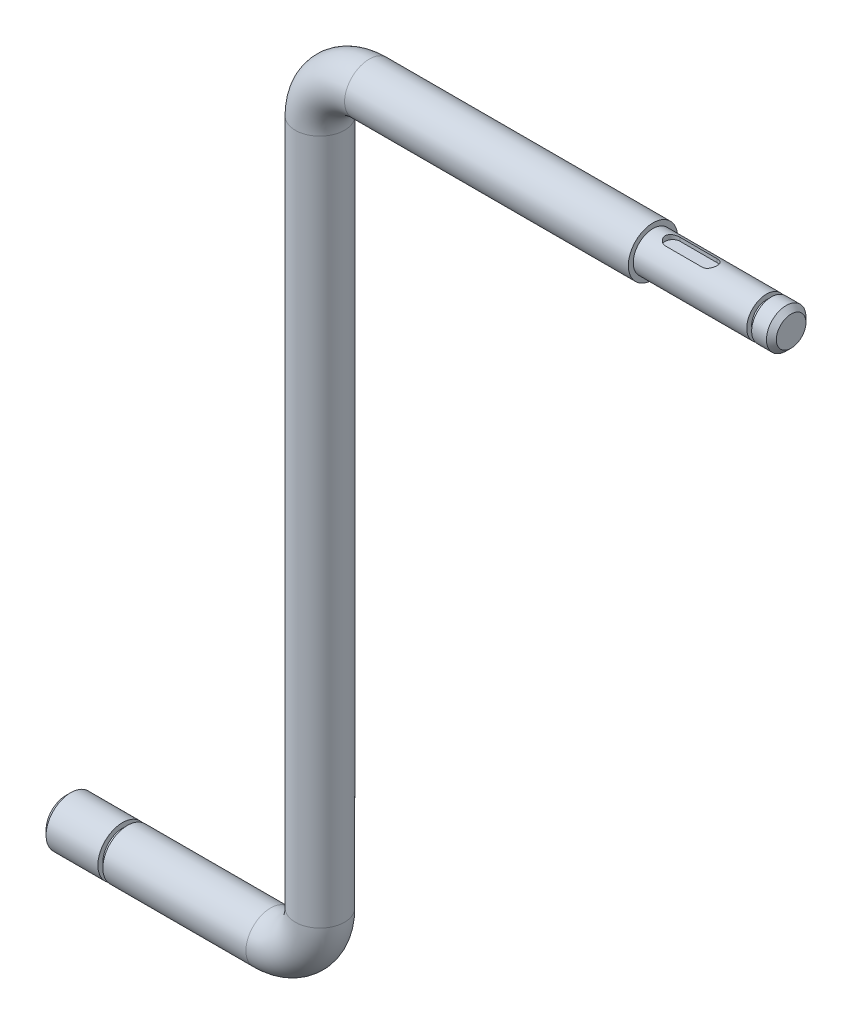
ISO-10303-21;
HEADER;
FILE_DESCRIPTION(('STEP AP214'),'2;1');
FILE_NAME('part.step','',(''),(''),'','','');
FILE_SCHEMA(('AUTOMOTIVE_DESIGN { 1 0 10303 214 1 1 1 1 }'));
ENDSEC;
DATA;
#1=APPLICATION_CONTEXT('core data for automotive mechanical design processes');
#2=APPLICATION_PROTOCOL_DEFINITION('international standard','automotive_design',2000,#1);
#3=PRODUCT_CONTEXT('',#1,'mechanical');
#4=PRODUCT('Part','Part','',(#3));
#5=PRODUCT_RELATED_PRODUCT_CATEGORY('part','',(#4));
#6=PRODUCT_DEFINITION_FORMATION('','',#4);
#7=PRODUCT_DEFINITION_CONTEXT('part definition',#1,'design');
#8=PRODUCT_DEFINITION('design','',#6,#7);
#9=PRODUCT_DEFINITION_SHAPE('','',#8);
#10=(LENGTH_UNIT() NAMED_UNIT(*) SI_UNIT(.MILLI.,.METRE.));
#11=(NAMED_UNIT(*) PLANE_ANGLE_UNIT() SI_UNIT($,.RADIAN.));
#12=(NAMED_UNIT(*) SI_UNIT($,.STERADIAN.) SOLID_ANGLE_UNIT());
#13=UNCERTAINTY_MEASURE_WITH_UNIT(LENGTH_MEASURE(1.E-05),#10,'distance_accuracy_value','');
#14=(GEOMETRIC_REPRESENTATION_CONTEXT(3) GLOBAL_UNCERTAINTY_ASSIGNED_CONTEXT((#13)) GLOBAL_UNIT_ASSIGNED_CONTEXT((#10,
#11,#12)) REPRESENTATION_CONTEXT('',''));
#15=CARTESIAN_POINT('',(0.,0.,0.));
#16=DIRECTION('',(0.,0.,1.));
#17=DIRECTION('',(1.,0.,0.));
#18=AXIS2_PLACEMENT_3D('',#15,#16,#17);
#19=CARTESIAN_POINT('',(147.,159.,0.));
#20=DIRECTION('',(-1.,0.,0.));
#21=DIRECTION('',(0.,-1.,0.));
#22=AXIS2_PLACEMENT_3D('',#19,#20,#21);
#23=CYLINDRICAL_SURFACE('',#22,4.);
#24=DIRECTION('',(-1.,0.,0.));
#25=VECTOR('',#24,1.);
#26=CARTESIAN_POINT('',(147.,162.708099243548,1.5));
#27=LINE('',#26,#25);
#28=CARTESIAN_POINT('',(130.5,162.708099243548,1.5));
#29=VERTEX_POINT('',#28);
#30=CARTESIAN_POINT('',(123.,162.708099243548,1.5));
#31=VERTEX_POINT('',#30);
#32=EDGE_CURVE('E469',#29,#31,#27,.T.);
#33=ORIENTED_EDGE('',*,*,#32,.T.);
#34=CARTESIAN_POINT('',(123.,162.708099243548,1.5));
#35=CARTESIAN_POINT('',(122.95940746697,162.708094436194,1.50000149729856));
#36=CARTESIAN_POINT('',(122.918836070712,162.708766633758,1.49835118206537));
#37=CARTESIAN_POINT('',(122.838015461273,162.711416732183,1.49177905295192));
#38=CARTESIAN_POINT('',(122.797766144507,162.713394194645,1.48685833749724));
#39=CARTESIAN_POINT('',(122.678232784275,162.721189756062,1.46729482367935));
#40=CARTESIAN_POINT('',(122.599800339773,162.728871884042,1.44784998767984));
#41=CARTESIAN_POINT('',(122.447632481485,162.748252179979,1.39690233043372));
#42=CARTESIAN_POINT('',(122.373893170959,162.759946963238,1.36540966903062));
#43=CARTESIAN_POINT('',(122.232666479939,162.786023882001,1.29134097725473));
#44=CARTESIAN_POINT('',(122.165184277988,162.800408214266,1.24875587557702));
#45=CARTESIAN_POINT('',(122.035108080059,162.831035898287,1.15146603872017));
#46=CARTESIAN_POINT('',(121.972869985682,162.847333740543,1.09630269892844));
#47=CARTESIAN_POINT('',(121.858276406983,162.879497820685,0.976394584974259));
#48=CARTESIAN_POINT('',(121.80592283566,162.895363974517,0.911647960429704));
#49=CARTESIAN_POINT('',(121.710859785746,162.925528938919,0.771693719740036));
#50=CARTESIAN_POINT('',(121.668539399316,162.939755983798,0.696204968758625));
#51=CARTESIAN_POINT('',(121.597348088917,162.964380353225,0.538553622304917));
#52=CARTESIAN_POINT('',(121.568472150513,162.974779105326,0.456393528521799));
#53=CARTESIAN_POINT('',(121.526242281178,162.990186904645,0.291490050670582));
#54=CARTESIAN_POINT('',(121.512272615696,162.99540906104,0.208924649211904));
#55=CARTESIAN_POINT('',(121.498278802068,163.000640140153,0.0424658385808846));
#56=CARTESIAN_POINT('',(121.498250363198,163.000650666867,-0.0414271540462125));
#57=CARTESIAN_POINT('',(121.511781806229,162.995592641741,-0.20374410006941));
#58=CARTESIAN_POINT('',(121.524669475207,162.990775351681,-0.282233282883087));
#59=CARTESIAN_POINT('',(121.562536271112,162.976932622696,-0.435840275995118));
#60=CARTESIAN_POINT('',(121.587516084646,162.967906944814,-0.510957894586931));
#61=CARTESIAN_POINT('',(121.649170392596,162.946377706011,-0.65698891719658));
#62=CARTESIAN_POINT('',(121.686009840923,162.933825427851,-0.727825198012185));
#63=CARTESIAN_POINT('',(121.770192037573,162.906513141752,-0.862486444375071));
#64=CARTESIAN_POINT('',(121.817538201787,162.891752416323,-0.926309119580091));
#65=CARTESIAN_POINT('',(121.924623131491,162.860526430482,-1.04908600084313));
#66=CARTESIAN_POINT('',(121.984924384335,162.844011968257,-1.10753779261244));
#67=CARTESIAN_POINT('',(122.114584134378,162.811826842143,-1.21369725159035));
#68=CARTESIAN_POINT('',(122.183946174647,162.796156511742,-1.26140069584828));
#69=CARTESIAN_POINT('',(122.331758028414,162.767118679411,-1.34567998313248));
#70=CARTESIAN_POINT('',(122.410378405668,162.753811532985,-1.38197861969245));
#71=CARTESIAN_POINT('',(122.573206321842,162.731714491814,-1.44059114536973));
#72=CARTESIAN_POINT('',(122.657404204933,162.722917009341,-1.46292853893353));
#73=CARTESIAN_POINT('',(122.785381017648,162.714062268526,-1.48519272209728));
#74=CARTESIAN_POINT('',(122.828102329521,162.711834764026,-1.49074028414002));
#75=CARTESIAN_POINT('',(122.913874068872,162.708850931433,-1.49814308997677));
#76=CARTESIAN_POINT('',(122.956924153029,162.708093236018,-1.50000176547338));
#77=CARTESIAN_POINT('',(123.,162.708099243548,-1.5));
#78=B_SPLINE_CURVE_WITH_KNOTS('',3,(#34,#35,#36,#37,#38,#39,#40,#41,#42,#43,#44,#45,#46,#47,#48,
#49,#50,#51,#52,#53,#54,#55,#56,#57,#58,#59,#60,#61,#62,#63,#64,#65,#66,#67,#68,#69,#70,#71,#72,
#73,#74,#75,#76,#77),.UNSPECIFIED.,.F.,.F.,(4,2,2,2,2,2,2,2,2,2,2,2,2,2,2,2,2,2,2,2,2,4),(0.,
0.121697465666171,0.243354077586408,0.485593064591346,0.727628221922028,0.969861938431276,
1.22298027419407,1.47614754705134,1.73793539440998,1.9996255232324,2.25002925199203,
2.50035591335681,2.73829765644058,2.97625291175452,3.21767225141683,3.45917019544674,
3.7147799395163,3.97048993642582,4.23200510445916,4.4930788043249,4.62233004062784,
4.75146098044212),.UNSPECIFIED.);
#79=CARTESIAN_POINT('',(123.,162.708099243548,-1.5));
#80=VERTEX_POINT('',#79);
#81=EDGE_CURVE('E11',#31,#80,#78,.T.);
#82=ORIENTED_EDGE('',*,*,#81,.T.);
#83=DIRECTION('',(-1.,0.,0.));
#84=VECTOR('',#83,1.);
#85=CARTESIAN_POINT('',(147.,162.708099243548,-1.5));
#86=LINE('',#85,#84);
#87=CARTESIAN_POINT('',(130.5,162.708099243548,-1.5));
#88=VERTEX_POINT('',#87);
#89=EDGE_CURVE('E363',#80,#88,#86,.F.);
#90=ORIENTED_EDGE('',*,*,#89,.T.);
#91=CARTESIAN_POINT('',(130.5,162.708099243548,1.5));
#92=CARTESIAN_POINT('',(130.418992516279,162.708096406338,1.50000304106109));
#93=CARTESIAN_POINT('',(130.338005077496,162.71078260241,1.49341597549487));
#94=CARTESIAN_POINT('',(130.178471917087,162.72116159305,1.46736187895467));
#95=CARTESIAN_POINT('',(130.099926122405,162.728854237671,1.44789523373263));
#96=CARTESIAN_POINT('',(129.947624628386,162.748254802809,1.39689657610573));
#97=CARTESIAN_POINT('',(129.873857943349,162.759953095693,1.36539347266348));
#98=CARTESIAN_POINT('',(129.732628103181,162.786031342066,1.29131856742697));
#99=CARTESIAN_POINT('',(129.665166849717,162.800412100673,1.24874344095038));
#100=CARTESIAN_POINT('',(129.535109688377,162.831035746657,1.15146661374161));
#101=CARTESIAN_POINT('',(129.472871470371,162.847333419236,1.09630381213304));
#102=CARTESIAN_POINT('',(129.358277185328,162.879497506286,0.976395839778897));
#103=CARTESIAN_POINT('',(129.305923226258,162.895363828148,0.911648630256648));
#104=CARTESIAN_POINT('',(129.210860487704,162.925528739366,0.771694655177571));
#105=CARTESIAN_POINT('',(129.168540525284,162.939755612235,0.696206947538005));
#106=CARTESIAN_POINT('',(129.097348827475,162.964380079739,0.538555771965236));
#107=CARTESIAN_POINT('',(129.068472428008,162.97477900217,0.45639463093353));
#108=CARTESIAN_POINT('',(129.026242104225,162.990186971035,0.29148934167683));
#109=CARTESIAN_POINT('',(129.01227237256,162.995409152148,0.208923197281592));
#110=CARTESIAN_POINT('',(128.998278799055,163.00064014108,0.0424643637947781));
#111=CARTESIAN_POINT('',(128.998250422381,163.000650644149,-0.041427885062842));
#112=CARTESIAN_POINT('',(129.011781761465,162.995592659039,-0.203743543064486));
#113=CARTESIAN_POINT('',(129.024669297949,162.990775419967,-0.282232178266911));
#114=CARTESIAN_POINT('',(129.062535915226,162.976932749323,-0.435839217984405));
#115=CARTESIAN_POINT('',(129.087515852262,162.967907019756,-0.510957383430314));
#116=CARTESIAN_POINT('',(129.149170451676,162.946377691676,-0.656989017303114));
#117=CARTESIAN_POINT('',(129.186010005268,162.933825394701,-0.727825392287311));
#118=CARTESIAN_POINT('',(129.270192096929,162.906513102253,-0.86248660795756));
#119=CARTESIAN_POINT('',(129.317538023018,162.891752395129,-0.92630917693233));
#120=CARTESIAN_POINT('',(129.424627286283,162.860525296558,-1.04909048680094));
#121=CARTESIAN_POINT('',(129.48493391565,162.844009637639,-1.10754614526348));
#122=CARTESIAN_POINT('',(129.614592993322,162.811824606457,-1.21370395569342));
#123=CARTESIAN_POINT('',(129.683947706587,162.796155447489,-1.261403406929));
#124=CARTESIAN_POINT('',(129.831719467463,162.767127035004,-1.34565611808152));
#125=CARTESIAN_POINT('',(129.910303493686,162.753826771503,-1.38193847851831));
#126=CARTESIAN_POINT('',(130.073096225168,162.73172438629,-1.44056464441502));
#127=CARTESIAN_POINT('',(130.157301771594,162.722919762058,-1.46291620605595));
#128=CARTESIAN_POINT('',(130.323975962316,162.711395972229,-1.49190191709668));
#129=CARTESIAN_POINT('',(130.406284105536,162.708367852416,-1.49933521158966));
#130=CARTESIAN_POINT('',(130.571009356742,162.70786539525,-1.50057885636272));
#131=CARTESIAN_POINT('',(130.653426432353,162.71038967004,-1.49439261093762));
#132=CARTESIAN_POINT('',(130.811929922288,162.720393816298,-1.46929733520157));
#133=CARTESIAN_POINT('',(130.888131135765,162.727632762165,-1.45100618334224));
#134=CARTESIAN_POINT('',(131.03634794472,162.745964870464,-1.40299774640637));
#135=CARTESIAN_POINT('',(131.108362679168,162.757058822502,-1.37327812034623));
#136=CARTESIAN_POINT('',(131.249164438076,162.782362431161,-1.30200292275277));
#137=CARTESIAN_POINT('',(131.317729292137,162.796673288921,-1.26004545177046));
#138=CARTESIAN_POINT('',(131.447128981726,162.826628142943,-1.16591317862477));
#139=CARTESIAN_POINT('',(131.507960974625,162.842272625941,-1.11373463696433));
#140=CARTESIAN_POINT('',(131.624168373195,162.874330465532,-0.996727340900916));
#141=CARTESIAN_POINT('',(131.678953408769,162.89072969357,-0.931306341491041));
#142=CARTESIAN_POINT('',(131.776838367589,162.921498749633,-0.791797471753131));
#143=CARTESIAN_POINT('',(131.819938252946,162.935868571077,-0.717709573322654));
#144=CARTESIAN_POINT('',(131.8929460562,162.960949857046,-0.563016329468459));
#145=CARTESIAN_POINT('',(131.922899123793,162.97167381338,-0.48243443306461));
#146=CARTESIAN_POINT('',(131.96865641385,162.988294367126,-0.316881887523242));
#147=CARTESIAN_POINT('',(131.984467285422,162.994193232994,-0.231913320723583));
#148=CARTESIAN_POINT('',(132.000774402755,163.000284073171,-0.065335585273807));
#149=CARTESIAN_POINT('',(132.002109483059,163.000788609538,0.0161807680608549));
#150=CARTESIAN_POINT('',(131.991584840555,162.996848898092,0.178226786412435));
#151=CARTESIAN_POINT('',(131.979726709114,162.992405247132,0.258756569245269));
#152=CARTESIAN_POINT('',(131.943741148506,162.979210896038,0.414548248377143));
#153=CARTESIAN_POINT('',(131.919920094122,162.97056791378,0.489890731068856));
#154=CARTESIAN_POINT('',(131.860989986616,162.94987783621,0.635515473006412));
#155=CARTESIAN_POINT('',(131.825878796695,162.937830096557,0.705796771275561));
#156=CARTESIAN_POINT('',(131.743686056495,162.910906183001,0.842540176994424));
#157=CARTESIAN_POINT('',(131.696163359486,162.895932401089,0.908717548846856));
#158=CARTESIAN_POINT('',(131.591192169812,162.864995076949,1.03241734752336));
#159=CARTESIAN_POINT('',(131.533740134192,162.849031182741,1.0899366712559));
#160=CARTESIAN_POINT('',(131.406935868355,162.816881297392,1.19781214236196));
#161=CARTESIAN_POINT('',(131.337115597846,162.800728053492,1.24762999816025));
#162=CARTESIAN_POINT('',(131.189584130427,162.770983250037,1.33484709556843));
#163=CARTESIAN_POINT('',(131.111872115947,162.757391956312,1.37224504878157));
#164=CARTESIAN_POINT('',(130.947044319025,162.734022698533,1.43465886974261));
#165=CARTESIAN_POINT('',(130.859665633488,162.724438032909,1.45906002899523));
#166=CARTESIAN_POINT('',(130.681514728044,162.711479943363,1.49172356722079));
#167=CARTESIAN_POINT('',(130.59074478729,162.708102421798,1.49999659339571));
#168=CARTESIAN_POINT('',(130.5,162.708099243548,1.5));
#169=B_SPLINE_CURVE_WITH_KNOTS('',3,(#91,#92,#93,#94,#95,#96,#97,#98,#99,#100,#101,#102,#103,
#104,#105,#106,#107,#108,#109,#110,#111,#112,#113,#114,#115,#116,#117,#118,#119,#120,#121,#122,
#123,#124,#125,#126,#127,#128,#129,#130,#131,#132,#133,#134,#135,#136,#137,#138,#139,#140,#141,
#142,#143,#144,#145,#146,#147,#148,#149,#150,#151,#152,#153,#154,#155,#156,#157,#158,#159,#160,
#161,#162,#163,#164,#165,#166,#167,#168),.UNSPECIFIED.,.T.,.F.,(4,2,2,2,2,2,2,2,2,2,2,2,2,2,2,2,
2,2,2,2,2,2,2,2,2,2,2,2,2,2,2,2,2,2,2,2,2,2,4),(0.,0.242684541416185,0.485361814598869,
0.727459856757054,0.969630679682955,1.2227465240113,1.47591628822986,1.73770072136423,
1.99939426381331,2.2498001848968,2.50012465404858,2.73806472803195,2.97602165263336,
3.21744131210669,3.45893893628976,3.71456675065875,3.97025867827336,4.23162592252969,
4.49284751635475,4.73965657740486,4.98640395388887,5.221438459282,5.45652113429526,
5.70041561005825,5.94439948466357,6.20385016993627,6.4633016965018,6.7218550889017,
6.98028685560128,7.22365720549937,7.46699820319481,7.70440274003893,7.94185223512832,
8.18928323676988,8.43680270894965,8.69738599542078,8.95799630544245,9.23003178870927,
9.50188762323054),.UNSPECIFIED.);
#170=EDGE_CURVE('E479',#88,#29,#169,.T.);
#171=ORIENTED_EDGE('',*,*,#170,.T.);
#172=EDGE_LOOP('',(#33,#82,#90,#171));
#173=FACE_BOUND('',#172,.T.);
#174=CARTESIAN_POINT('',(119.,159.,0.));
#175=DIRECTION('',(1.,0.,0.));
#176=DIRECTION('',(0.,1.,0.));
#177=AXIS2_PLACEMENT_3D('',#174,#175,#176);
#178=CIRCLE('',#177,4.);
#179=CARTESIAN_POINT('',(119.,163.,0.));
#180=VERTEX_POINT('',#179);
#181=EDGE_CURVE('E438',#180,#180,#178,.T.);
#182=ORIENTED_EDGE('',*,*,#181,.T.);
#183=EDGE_LOOP('',(#182));
#184=FACE_BOUND('',#183,.T.);
#185=CARTESIAN_POINT('',(142.,159.,0.));
#186=DIRECTION('',(1.,0.,0.));
#187=DIRECTION('',(0.,0.,-1.));
#188=AXIS2_PLACEMENT_3D('',#185,#186,#187);
#189=CIRCLE('',#188,4.);
#190=CARTESIAN_POINT('',(142.,159.,-4.));
#191=VERTEX_POINT('',#190);
#192=EDGE_CURVE('E434',#191,#191,#189,.T.);
#193=ORIENTED_EDGE('',*,*,#192,.F.);
#194=EDGE_LOOP('',(#193));
#195=FACE_BOUND('',#194,.T.);
#196=ADVANCED_FACE('F350',(#173,#184,#195),#23,.T.);
#197=CARTESIAN_POINT('',(41.4999999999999,0.,0.));
#198=DIRECTION('',(-1.,0.,0.));
#199=DIRECTION('',(0.,0.,1.));
#200=AXIS2_PLACEMENT_3D('',#197,#198,#199);
#201=CYLINDRICAL_SURFACE('',#200,5.);
#202=CARTESIAN_POINT('',(41.4999999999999,0.,0.));
#203=DIRECTION('',(1.,0.,0.));
#204=DIRECTION('',(0.,0.,-1.));
#205=AXIS2_PLACEMENT_3D('',#202,#203,#204);
#206=CIRCLE('',#205,5.);
#207=CARTESIAN_POINT('',(41.4999999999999,-5.,0.));
#208=VERTEX_POINT('',#207);
#209=EDGE_CURVE('E441',#208,#208,#206,.T.);
#210=ORIENTED_EDGE('',*,*,#209,.F.);
#211=EDGE_LOOP('',(#210));
#212=FACE_BOUND('',#211,.T.);
#213=CARTESIAN_POINT('',(12.5,0.,0.));
#214=DIRECTION('',(-1.,0.,0.));
#215=DIRECTION('',(0.,0.,1.));
#216=AXIS2_PLACEMENT_3D('',#213,#214,#215);
#217=CIRCLE('',#216,5.);
#218=CARTESIAN_POINT('',(12.5,0.,5.));
#219=VERTEX_POINT('',#218);
#220=EDGE_CURVE('E437',#219,#219,#217,.T.);
#221=ORIENTED_EDGE('',*,*,#220,.F.);
#222=EDGE_LOOP('',(#221));
#223=FACE_BOUND('',#222,.T.);
#224=ADVANCED_FACE('F536',(#212,#223),#201,.T.);
#225=CARTESIAN_POINT('',(119.,159.,0.));
#226=DIRECTION('',(1.,0.,0.));
#227=DIRECTION('',(0.,0.,-1.));
#228=AXIS2_PLACEMENT_3D('',#225,#226,#227);
#229=PLANE('',#228);
#230=CARTESIAN_POINT('',(119.,159.,0.));
#231=DIRECTION('',(1.,0.,0.));
#232=DIRECTION('',(0.,0.,-1.));
#233=AXIS2_PLACEMENT_3D('',#230,#231,#232);
#234=CIRCLE('',#233,5.);
#235=CARTESIAN_POINT('',(119.,159.,-5.));
#236=VERTEX_POINT('',#235);
#237=EDGE_CURVE('E454',#236,#236,#234,.T.);
#238=ORIENTED_EDGE('',*,*,#237,.T.);
#239=EDGE_LOOP('',(#238));
#240=FACE_BOUND('',#239,.T.);
#241=ORIENTED_EDGE('',*,*,#181,.F.);
#242=EDGE_LOOP('',(#241));
#243=FACE_BOUND('',#242,.T.);
#244=ADVANCED_FACE('F541',(#240,#243),#229,.T.);
#245=CARTESIAN_POINT('',(61.5000000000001,159.,0.));
#246=DIRECTION('',(1.,0.,0.));
#247=DIRECTION('',(0.,0.,-1.));
#248=AXIS2_PLACEMENT_3D('',#245,#246,#247);
#249=CYLINDRICAL_SURFACE('',#248,5.);
#250=CARTESIAN_POINT('',(61.5000000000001,159.,0.));
#251=DIRECTION('',(1.,0.,0.));
#252=DIRECTION('',(0.,0.,-1.));
#253=AXIS2_PLACEMENT_3D('',#250,#251,#252);
#254=CIRCLE('',#253,5.);
#255=CARTESIAN_POINT('',(61.5000000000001,164.,0.));
#256=VERTEX_POINT('',#255);
#257=EDGE_CURVE('E451',#256,#256,#254,.T.);
#258=ORIENTED_EDGE('',*,*,#257,.T.);
#259=EDGE_LOOP('',(#258));
#260=FACE_BOUND('',#259,.T.);
#261=ORIENTED_EDGE('',*,*,#237,.F.);
#262=EDGE_LOOP('',(#261));
#263=FACE_BOUND('',#262,.T.);
#264=ADVANCED_FACE('F352',(#260,#263),#249,.T.);
#265=CARTESIAN_POINT('',(61.5,149.,0.));
#266=DIRECTION('',(0.,0.,-1.));
#267=DIRECTION('',(-1.,0.,0.));
#268=AXIS2_PLACEMENT_3D('',#265,#266,#267);
#269=TOROIDAL_SURFACE('',#268,10.,5.);
#270=CARTESIAN_POINT('',(51.5,149.,0.));
#271=DIRECTION('',(0.,1.,0.));
#272=DIRECTION('',(0.,0.,-1.));
#273=AXIS2_PLACEMENT_3D('',#270,#271,#272);
#274=CIRCLE('',#273,5.);
#275=CARTESIAN_POINT('',(46.5,149.,0.));
#276=VERTEX_POINT('',#275);
#277=EDGE_CURVE('E448',#276,#276,#274,.T.);
#278=CARTESIAN_POINT('',(61.5,149.,0.));
#279=DIRECTION('',(0.,0.,-1.));
#280=DIRECTION('',(-1.,0.,0.));
#281=AXIS2_PLACEMENT_3D('',#278,#279,#280);
#282=CIRCLE('',#281,15.);
#283=EDGE_CURVE('',#276,#256,#282,.T.);
#284=ORIENTED_EDGE('',*,*,#277,.T.);
#285=ORIENTED_EDGE('',*,*,#257,.F.);
#286=ORIENTED_EDGE('',*,*,#283,.T.);
#287=ORIENTED_EDGE('',*,*,#283,.F.);
#288=EDGE_LOOP('',(#284,#286,#285,#287));
#289=FACE_BOUND('',#288,.T.);
#290=ADVANCED_FACE('F641',(#289),#269,.T.);
#291=CARTESIAN_POINT('',(51.5,10.0000000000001,0.));
#292=DIRECTION('',(0.,1.,0.));
#293=DIRECTION('',(-1.,0.,0.));
#294=AXIS2_PLACEMENT_3D('',#291,#292,#293);
#295=CYLINDRICAL_SURFACE('',#294,5.);
#296=CARTESIAN_POINT('',(51.5,10.0000000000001,0.));
#297=DIRECTION('',(0.,1.,0.));
#298=DIRECTION('',(0.,0.,-1.));
#299=AXIS2_PLACEMENT_3D('',#296,#297,#298);
#300=CIRCLE('',#299,5.);
#301=CARTESIAN_POINT('',(56.5,10.0000000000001,0.));
#302=VERTEX_POINT('',#301);
#303=EDGE_CURVE('E445',#302,#302,#300,.T.);
#304=ORIENTED_EDGE('',*,*,#303,.T.);
#305=EDGE_LOOP('',(#304));
#306=FACE_BOUND('',#305,.T.);
#307=ORIENTED_EDGE('',*,*,#277,.F.);
#308=EDGE_LOOP('',(#307));
#309=FACE_BOUND('',#308,.T.);
#310=ADVANCED_FACE('F633',(#306,#309),#295,.T.);
#311=CARTESIAN_POINT('',(41.5,10.,0.));
#312=DIRECTION('',(0.,0.,1.));
#313=DIRECTION('',(1.,0.,0.));
#314=AXIS2_PLACEMENT_3D('',#311,#312,#313);
#315=TOROIDAL_SURFACE('',#314,10.,5.);
#316=CARTESIAN_POINT('',(41.5,10.,0.));
#317=DIRECTION('',(0.,0.,1.));
#318=DIRECTION('',(1.,0.,0.));
#319=AXIS2_PLACEMENT_3D('',#316,#317,#318);
#320=CIRCLE('',#319,15.);
#321=EDGE_CURVE('',#208,#302,#320,.T.);
#322=ORIENTED_EDGE('',*,*,#209,.T.);
#323=ORIENTED_EDGE('',*,*,#303,.F.);
#324=ORIENTED_EDGE('',*,*,#321,.T.);
#325=ORIENTED_EDGE('',*,*,#321,.F.);
#326=EDGE_LOOP('',(#322,#324,#323,#325));
#327=FACE_BOUND('',#326,.T.);
#328=ADVANCED_FACE('F526',(#327),#315,.T.);
#329=CARTESIAN_POINT('',(11.5,6.2,0.));
#330=DIRECTION('',(1.,0.,0.));
#331=DIRECTION('',(0.,0.,-1.));
#332=AXIS2_PLACEMENT_3D('',#329,#330,#331);
#333=PLANE('',#332);
#334=CARTESIAN_POINT('',(11.5,0.,0.));
#335=DIRECTION('',(-1.,0.,0.));
#336=DIRECTION('',(0.,0.,1.));
#337=AXIS2_PLACEMENT_3D('',#334,#335,#336);
#338=CIRCLE('',#337,4.);
#339=CARTESIAN_POINT('',(11.5,0.,4.));
#340=VERTEX_POINT('',#339);
#341=EDGE_CURVE('E433',#340,#340,#338,.T.);
#342=ORIENTED_EDGE('',*,*,#341,.T.);
#343=EDGE_LOOP('',(#342));
#344=FACE_BOUND('',#343,.T.);
#345=CARTESIAN_POINT('',(11.5,0.,0.));
#346=DIRECTION('',(1.,0.,0.));
#347=DIRECTION('',(0.,0.,-1.));
#348=AXIS2_PLACEMENT_3D('',#345,#346,#347);
#349=CIRCLE('',#348,5.);
#350=CARTESIAN_POINT('',(11.5,0.,-5.));
#351=VERTEX_POINT('',#350);
#352=EDGE_CURVE('E442',#351,#351,#349,.T.);
#353=ORIENTED_EDGE('',*,*,#352,.T.);
#354=EDGE_LOOP('',(#353));
#355=FACE_BOUND('',#354,.T.);
#356=ADVANCED_FACE('F518',(#344,#355),#333,.T.);
#357=CARTESIAN_POINT('',(12.5,6.2,0.));
#358=DIRECTION('',(-1.,0.,0.));
#359=DIRECTION('',(0.,0.,1.));
#360=AXIS2_PLACEMENT_3D('',#357,#358,#359);
#361=PLANE('',#360);
#362=CARTESIAN_POINT('',(12.5,0.,0.));
#363=DIRECTION('',(-1.,0.,0.));
#364=DIRECTION('',(0.,0.,1.));
#365=AXIS2_PLACEMENT_3D('',#362,#363,#364);
#366=CIRCLE('',#365,4.);
#367=CARTESIAN_POINT('',(12.5,0.,4.));
#368=VERTEX_POINT('',#367);
#369=EDGE_CURVE('E430',#368,#368,#366,.T.);
#370=ORIENTED_EDGE('',*,*,#369,.F.);
#371=EDGE_LOOP('',(#370));
#372=FACE_BOUND('',#371,.T.);
#373=ORIENTED_EDGE('',*,*,#220,.T.);
#374=EDGE_LOOP('',(#373));
#375=FACE_BOUND('',#374,.T.);
#376=ADVANCED_FACE('F514',(#372,#375),#361,.T.);
#377=CARTESIAN_POINT('',(0.,0.,0.));
#378=DIRECTION('',(-1.,0.,0.));
#379=DIRECTION('',(0.,0.,1.));
#380=AXIS2_PLACEMENT_3D('',#377,#378,#379);
#381=CYLINDRICAL_SURFACE('',#380,4.);
#382=ORIENTED_EDGE('',*,*,#369,.T.);
#383=EDGE_LOOP('',(#382));
#384=FACE_BOUND('',#383,.T.);
#385=ORIENTED_EDGE('',*,*,#341,.F.);
#386=EDGE_LOOP('',(#385));
#387=FACE_BOUND('',#386,.T.);
#388=ADVANCED_FACE('F517',(#384,#387),#381,.T.);
#389=CARTESIAN_POINT('',(0.,0.,0.));
#390=DIRECTION('',(1.,0.,0.));
#391=DIRECTION('',(0.,0.,-1.));
#392=AXIS2_PLACEMENT_3D('',#389,#390,#391);
#393=PLANE('',#392);
#394=CARTESIAN_POINT('',(0.,0.,0.));
#395=DIRECTION('',(1.,0.,0.));
#396=DIRECTION('',(0.,0.,-1.));
#397=AXIS2_PLACEMENT_3D('',#394,#395,#396);
#398=CIRCLE('',#397,3.99999999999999);
#399=CARTESIAN_POINT('',(0.,0.,-3.99999999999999));
#400=VERTEX_POINT('',#399);
#401=EDGE_CURVE('E460',#400,#400,#398,.F.);
#402=ORIENTED_EDGE('',*,*,#401,.T.);
#403=EDGE_LOOP('',(#402));
#404=FACE_BOUND('',#403,.T.);
#405=ADVANCED_FACE('F522',(#404),#393,.F.);
#406=CARTESIAN_POINT('',(1.,0.,0.));
#407=DIRECTION('',(1.,0.,0.));
#408=DIRECTION('',(0.,0.,-1.));
#409=AXIS2_PLACEMENT_3D('',#406,#407,#408);
#410=CONICAL_SURFACE('',#409,5.,0.78539816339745);
#411=ORIENTED_EDGE('',*,*,#401,.F.);
#412=EDGE_LOOP('',(#411));
#413=FACE_BOUND('',#412,.T.);
#414=CARTESIAN_POINT('',(1.,0.,0.));
#415=DIRECTION('',(1.,0.,0.));
#416=DIRECTION('',(0.,0.,-1.));
#417=AXIS2_PLACEMENT_3D('',#414,#415,#416);
#418=CIRCLE('',#417,5.);
#419=CARTESIAN_POINT('',(1.,0.,-5.));
#420=VERTEX_POINT('',#419);
#421=EDGE_CURVE('E457',#420,#420,#418,.T.);
#422=ORIENTED_EDGE('',*,*,#421,.F.);
#423=EDGE_LOOP('',(#422));
#424=FACE_BOUND('',#423,.T.);
#425=ADVANCED_FACE('F600',(#413,#424),#410,.T.);
#426=ORIENTED_EDGE('',*,*,#421,.T.);
#427=EDGE_LOOP('',(#426));
#428=FACE_BOUND('',#427,.T.);
#429=ORIENTED_EDGE('',*,*,#352,.F.);
#430=EDGE_LOOP('',(#429));
#431=FACE_BOUND('',#430,.T.);
#432=ADVANCED_FACE('F512',(#428,#431),#201,.T.);
#433=CARTESIAN_POINT('',(142.,164.1,0.));
#434=DIRECTION('',(1.,0.,0.));
#435=DIRECTION('',(0.,0.,-1.));
#436=AXIS2_PLACEMENT_3D('',#433,#434,#435);
#437=PLANE('',#436);
#438=CARTESIAN_POINT('',(142.,159.,0.));
#439=DIRECTION('',(-1.,0.,0.));
#440=DIRECTION('',(0.,0.,1.));
#441=AXIS2_PLACEMENT_3D('',#438,#439,#440);
#442=CIRCLE('',#441,3.);
#443=CARTESIAN_POINT('',(142.,159.,3.));
#444=VERTEX_POINT('',#443);
#445=EDGE_CURVE('E426',#444,#444,#442,.T.);
#446=ORIENTED_EDGE('',*,*,#445,.T.);
#447=EDGE_LOOP('',(#446));
#448=FACE_BOUND('',#447,.T.);
#449=ORIENTED_EDGE('',*,*,#192,.T.);
#450=EDGE_LOOP('',(#449));
#451=FACE_BOUND('',#450,.T.);
#452=ADVANCED_FACE('F504',(#448,#451),#437,.T.);
#453=CARTESIAN_POINT('',(143.,164.1,0.));
#454=DIRECTION('',(-1.,0.,0.));
#455=DIRECTION('',(0.,0.,1.));
#456=AXIS2_PLACEMENT_3D('',#453,#454,#455);
#457=PLANE('',#456);
#458=CARTESIAN_POINT('',(143.,159.,0.));
#459=DIRECTION('',(-1.,0.,0.));
#460=DIRECTION('',(0.,0.,1.));
#461=AXIS2_PLACEMENT_3D('',#458,#459,#460);
#462=CIRCLE('',#461,3.);
#463=CARTESIAN_POINT('',(143.,159.,3.));
#464=VERTEX_POINT('',#463);
#465=EDGE_CURVE('E420',#464,#464,#462,.T.);
#466=ORIENTED_EDGE('',*,*,#465,.F.);
#467=EDGE_LOOP('',(#466));
#468=FACE_BOUND('',#467,.T.);
#469=CARTESIAN_POINT('',(143.,159.,0.));
#470=DIRECTION('',(-1.,0.,0.));
#471=DIRECTION('',(0.,0.,1.));
#472=AXIS2_PLACEMENT_3D('',#469,#470,#471);
#473=CIRCLE('',#472,4.);
#474=CARTESIAN_POINT('',(143.,159.,4.));
#475=VERTEX_POINT('',#474);
#476=EDGE_CURVE('E429',#475,#475,#473,.T.);
#477=ORIENTED_EDGE('',*,*,#476,.T.);
#478=EDGE_LOOP('',(#477));
#479=FACE_BOUND('',#478,.T.);
#480=ADVANCED_FACE('F500',(#468,#479),#457,.T.);
#481=CARTESIAN_POINT('',(124.49847031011,159.,0.));
#482=DIRECTION('',(-1.,0.,0.));
#483=DIRECTION('',(0.,0.,1.));
#484=AXIS2_PLACEMENT_3D('',#481,#482,#483);
#485=CYLINDRICAL_SURFACE('',#484,3.);
#486=ORIENTED_EDGE('',*,*,#465,.T.);
#487=EDGE_LOOP('',(#486));
#488=FACE_BOUND('',#487,.T.);
#489=ORIENTED_EDGE('',*,*,#445,.F.);
#490=EDGE_LOOP('',(#489));
#491=FACE_BOUND('',#490,.T.);
#492=ADVANCED_FACE('F503',(#488,#491),#485,.T.);
#493=CARTESIAN_POINT('',(147.,159.,0.));
#494=DIRECTION('',(1.,0.,0.));
#495=DIRECTION('',(0.,1.,0.));
#496=AXIS2_PLACEMENT_3D('',#493,#494,#495);
#497=PLANE('',#496);
#498=CARTESIAN_POINT('',(147.,159.,0.));
#499=DIRECTION('',(1.,0.,0.));
#500=DIRECTION('',(0.,1.,0.));
#501=AXIS2_PLACEMENT_3D('',#498,#499,#500);
#502=CIRCLE('',#501,2.99999999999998);
#503=CARTESIAN_POINT('',(147.,162.,0.));
#504=VERTEX_POINT('',#503);
#505=EDGE_CURVE('E463',#504,#504,#502,.T.);
#506=ORIENTED_EDGE('',*,*,#505,.T.);
#507=EDGE_LOOP('',(#506));
#508=FACE_BOUND('',#507,.T.);
#509=ADVANCED_FACE('F508',(#508),#497,.T.);
#510=CARTESIAN_POINT('',(147.,159.,0.));
#511=DIRECTION('',(-1.,0.,0.));
#512=DIRECTION('',(0.,0.,1.));
#513=AXIS2_PLACEMENT_3D('',#510,#511,#512);
#514=CONICAL_SURFACE('',#513,2.99999999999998,0.785398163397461);
#515=CARTESIAN_POINT('',(146.,159.,0.));
#516=DIRECTION('',(1.,0.,0.));
#517=DIRECTION('',(0.,0.,-1.));
#518=AXIS2_PLACEMENT_3D('',#515,#516,#517);
#519=CIRCLE('',#518,4.);
#520=CARTESIAN_POINT('',(146.,159.,-4.));
#521=VERTEX_POINT('',#520);
#522=EDGE_CURVE('E466',#521,#521,#519,.F.);
#523=ORIENTED_EDGE('',*,*,#522,.F.);
#524=EDGE_LOOP('',(#523));
#525=FACE_BOUND('',#524,.T.);
#526=ORIENTED_EDGE('',*,*,#505,.F.);
#527=EDGE_LOOP('',(#526));
#528=FACE_BOUND('',#527,.T.);
#529=ADVANCED_FACE('F528',(#525,#528),#514,.T.);
#530=ORIENTED_EDGE('',*,*,#522,.T.);
#531=EDGE_LOOP('',(#530));
#532=FACE_BOUND('',#531,.T.);
#533=ORIENTED_EDGE('',*,*,#476,.F.);
#534=EDGE_LOOP('',(#533));
#535=FACE_BOUND('',#534,.T.);
#536=ADVANCED_FACE('F499',(#532,#535),#23,.T.);
#537=CARTESIAN_POINT('',(123.,162.,0.));
#538=DIRECTION('',(0.,1.,0.));
#539=DIRECTION('',(0.,0.,1.));
#540=AXIS2_PLACEMENT_3D('',#537,#538,#539);
#541=CYLINDRICAL_SURFACE('',#540,1.5);
#542=DIRECTION('',(0.,1.,0.));
#543=VECTOR('',#542,1.);
#544=CARTESIAN_POINT('',(123.,162.,1.5));
#545=LINE('',#544,#543);
#546=CARTESIAN_POINT('',(123.,162.,1.5));
#547=VERTEX_POINT('',#546);
#548=EDGE_CURVE('E370',#547,#31,#545,.T.);
#549=ORIENTED_EDGE('',*,*,#548,.F.);
#550=CARTESIAN_POINT('',(123.,162.,0.));
#551=DIRECTION('',(0.,1.,0.));
#552=DIRECTION('',(0.,0.,1.));
#553=AXIS2_PLACEMENT_3D('',#550,#551,#552);
#554=CIRCLE('',#553,1.5);
#555=CARTESIAN_POINT('',(123.,162.,-1.5));
#556=VERTEX_POINT('',#555);
#557=EDGE_CURVE('E397',#556,#547,#554,.T.);
#558=ORIENTED_EDGE('',*,*,#557,.F.);
#559=DIRECTION('',(0.,1.,0.));
#560=VECTOR('',#559,1.);
#561=CARTESIAN_POINT('',(123.,162.,-1.5));
#562=LINE('',#561,#560);
#563=EDGE_CURVE('E418',#556,#80,#562,.T.);
#564=ORIENTED_EDGE('',*,*,#563,.T.);
#565=ORIENTED_EDGE('',*,*,#81,.F.);
#566=EDGE_LOOP('',(#549,#558,#564,#565));
#567=FACE_BOUND('',#566,.T.);
#568=ADVANCED_FACE('F395',(#567),#541,.F.);
#569=CARTESIAN_POINT('',(130.5,162.,-1.5));
#570=DIRECTION('',(0.,0.,-1.));
#571=DIRECTION('',(-1.,0.,0.));
#572=AXIS2_PLACEMENT_3D('',#569,#570,#571);
#573=PLANE('',#572);
#574=ORIENTED_EDGE('',*,*,#563,.F.);
#575=DIRECTION('',(-1.,0.,0.));
#576=VECTOR('',#575,1.);
#577=CARTESIAN_POINT('',(130.5,162.,-1.5));
#578=LINE('',#577,#576);
#579=CARTESIAN_POINT('',(130.5,162.,-1.5));
#580=VERTEX_POINT('',#579);
#581=EDGE_CURVE('E401',#580,#556,#578,.T.);
#582=ORIENTED_EDGE('',*,*,#581,.F.);
#583=DIRECTION('',(0.,1.,0.));
#584=VECTOR('',#583,1.);
#585=CARTESIAN_POINT('',(130.5,162.,-1.5));
#586=LINE('',#585,#584);
#587=EDGE_CURVE('E421',#580,#88,#586,.T.);
#588=ORIENTED_EDGE('',*,*,#587,.T.);
#589=ORIENTED_EDGE('',*,*,#89,.F.);
#590=EDGE_LOOP('',(#574,#582,#588,#589));
#591=FACE_BOUND('',#590,.T.);
#592=ADVANCED_FACE('F492',(#591),#573,.F.);
#593=CARTESIAN_POINT('',(130.5,162.,0.));
#594=DIRECTION('',(0.,1.,0.));
#595=DIRECTION('',(0.,0.,1.));
#596=AXIS2_PLACEMENT_3D('',#593,#594,#595);
#597=CYLINDRICAL_SURFACE('',#596,1.5);
#598=ORIENTED_EDGE('',*,*,#587,.F.);
#599=CARTESIAN_POINT('',(130.5,162.,0.));
#600=DIRECTION('',(0.,1.,0.));
#601=DIRECTION('',(0.,0.,1.));
#602=AXIS2_PLACEMENT_3D('',#599,#600,#601);
#603=CIRCLE('',#602,1.5);
#604=CARTESIAN_POINT('',(130.5,162.,1.5));
#605=VERTEX_POINT('',#604);
#606=EDGE_CURVE('E410',#605,#580,#603,.T.);
#607=ORIENTED_EDGE('',*,*,#606,.F.);
#608=DIRECTION('',(0.,1.,0.));
#609=VECTOR('',#608,1.);
#610=CARTESIAN_POINT('',(130.5,162.,1.5));
#611=LINE('',#610,#609);
#612=EDGE_CURVE('E400',#605,#29,#611,.T.);
#613=ORIENTED_EDGE('',*,*,#612,.T.);
#614=ORIENTED_EDGE('',*,*,#170,.F.);
#615=EDGE_LOOP('',(#598,#607,#613,#614));
#616=FACE_BOUND('',#615,.T.);
#617=ADVANCED_FACE('F487',(#616),#597,.F.);
#618=CARTESIAN_POINT('',(130.5,162.,1.5));
#619=DIRECTION('',(0.,0.,1.));
#620=DIRECTION('',(1.,0.,0.));
#621=AXIS2_PLACEMENT_3D('',#618,#619,#620);
#622=PLANE('',#621);
#623=ORIENTED_EDGE('',*,*,#612,.F.);
#624=DIRECTION('',(1.,0.,0.));
#625=VECTOR('',#624,1.);
#626=CARTESIAN_POINT('',(130.5,162.,1.5));
#627=LINE('',#626,#625);
#628=EDGE_CURVE('E404',#547,#605,#627,.T.);
#629=ORIENTED_EDGE('',*,*,#628,.F.);
#630=ORIENTED_EDGE('',*,*,#548,.T.);
#631=ORIENTED_EDGE('',*,*,#32,.F.);
#632=EDGE_LOOP('',(#623,#629,#630,#631));
#633=FACE_BOUND('',#632,.T.);
#634=ADVANCED_FACE('F405',(#633),#622,.F.);
#635=CARTESIAN_POINT('',(123.,162.,0.));
#636=DIRECTION('',(0.,1.,0.));
#637=DIRECTION('',(0.,0.,1.));
#638=AXIS2_PLACEMENT_3D('',#635,#636,#637);
#639=PLANE('',#638);
#640=ORIENTED_EDGE('',*,*,#557,.T.);
#641=ORIENTED_EDGE('',*,*,#628,.T.);
#642=ORIENTED_EDGE('',*,*,#606,.T.);
#643=ORIENTED_EDGE('',*,*,#581,.T.);
#644=EDGE_LOOP('',(#640,#641,#642,#643));
#645=FACE_BOUND('',#644,.T.);
#646=ADVANCED_FACE('F412',(#645),#639,.T.);
#647=CLOSED_SHELL('',(#196,#224,#244,#264,#290,#310,#328,#356,#376,#388,#405,#425,#432,#452,
#480,#492,#509,#529,#536,#568,#592,#617,#634,#646));
#648=MANIFOLD_SOLID_BREP('B2',#647);
#649=ADVANCED_BREP_SHAPE_REPRESENTATION('',(#18,#648),#14);
#650=SHAPE_DEFINITION_REPRESENTATION(#9,#649);
ENDSEC;
END-ISO-10303-21;
